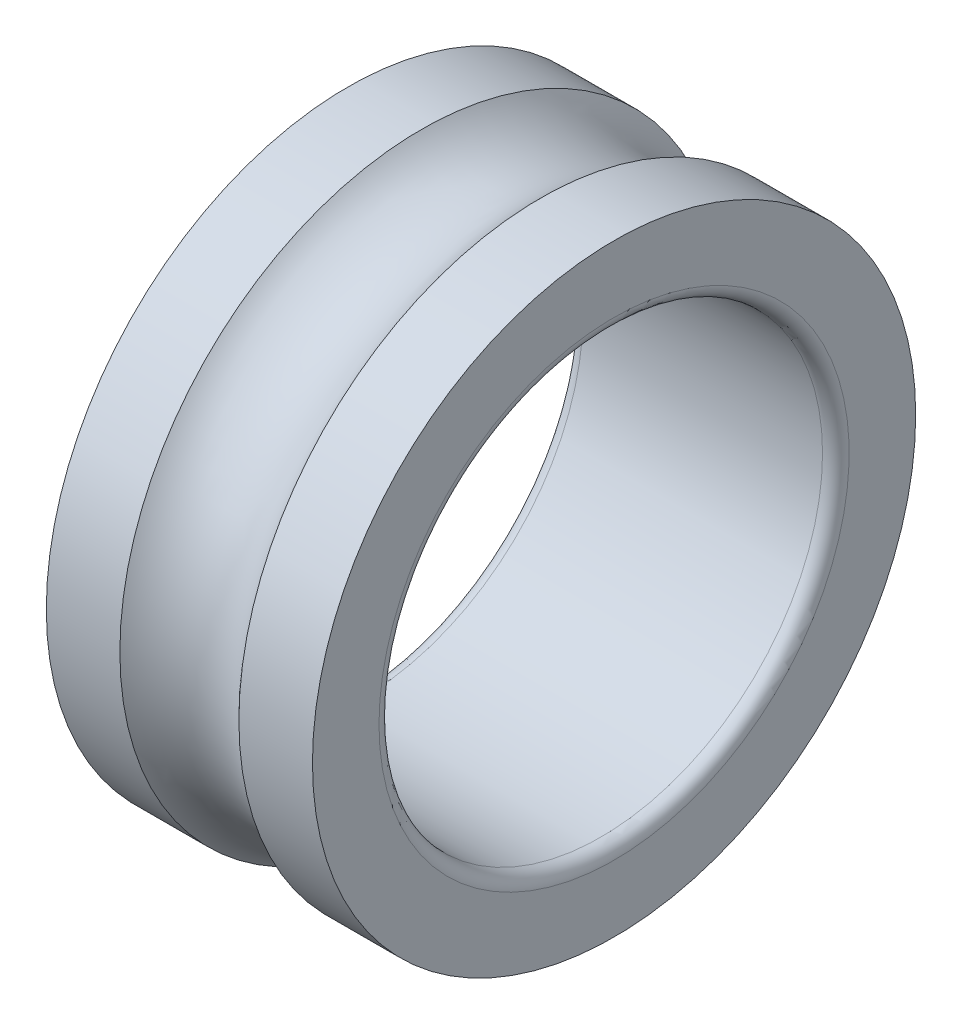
from build123d import *


with BuildPart() as part:
    # Esquisse1 → Base-R_volution (revolve)
    with BuildSketch(Plane(origin=(0, 0, 0), x_dir=(1, 0, 0), z_dir=(0, 1, 0)), mode=Mode.PRIVATE) as base_r_volution_sk:
        with BuildLine():
            Line((0, 3.4), (0, 2.65))
            ThreePointArc((0, 2.65), (0.043933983, 2.543933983), (0.15, 2.5))
            Line((0.15, 2.5), (2.85, 2.5))
            ThreePointArc((2.85, 2.5), (2.956066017, 2.543933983), (3, 2.65))
            Line((3, 2.65), (3, 3.4))
            Line((3, 3.4), (2.170820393, 3.4))
            ThreePointArc((2.170820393, 3.4), (1.5, 3.1), (0.829179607, 3.4))
            Line((0.829179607, 3.4), (0, 3.4))
        make_face()
    revolve(base_r_volution_sk.sketch.rotate(Axis((0, 0, 0), (1, 0, 0)), 180), axis=Axis((0, 0, 0), (1, 0, 0)))


solid = part.part
